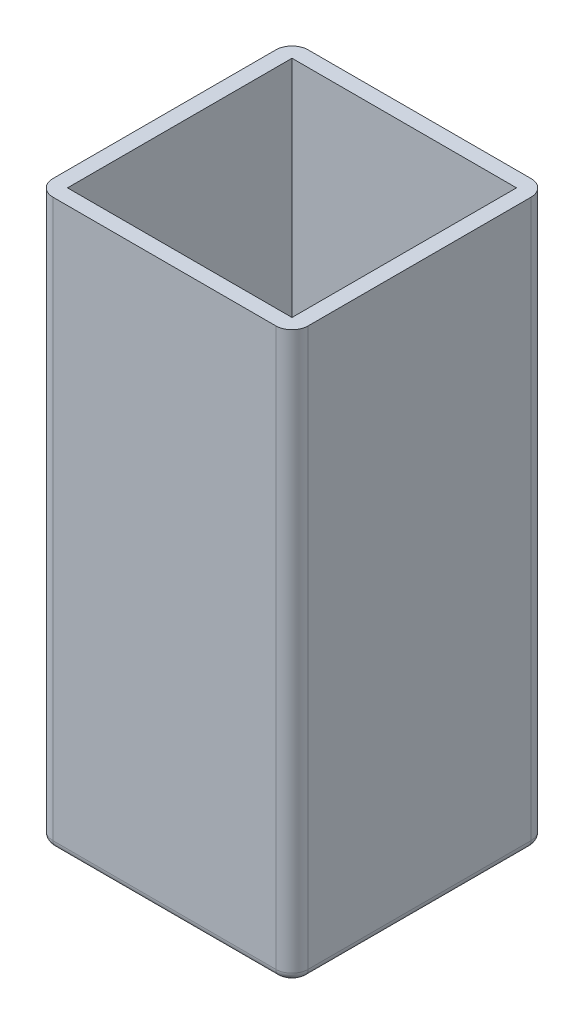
ISO-10303-21;
HEADER;
FILE_DESCRIPTION(('STEP AP214'),'2;1');
FILE_NAME('part.step','',(''),(''),'','','');
FILE_SCHEMA(('AUTOMOTIVE_DESIGN { 1 0 10303 214 1 1 1 1 }'));
ENDSEC;
DATA;
#1=APPLICATION_CONTEXT('core data for automotive mechanical design processes');
#2=APPLICATION_PROTOCOL_DEFINITION('international standard','automotive_design',2000,#1);
#3=PRODUCT_CONTEXT('',#1,'mechanical');
#4=PRODUCT('Part','Part','',(#3));
#5=PRODUCT_RELATED_PRODUCT_CATEGORY('part','',(#4));
#6=PRODUCT_DEFINITION_FORMATION('','',#4);
#7=PRODUCT_DEFINITION_CONTEXT('part definition',#1,'design');
#8=PRODUCT_DEFINITION('design','',#6,#7);
#9=PRODUCT_DEFINITION_SHAPE('','',#8);
#10=(LENGTH_UNIT() NAMED_UNIT(*) SI_UNIT(.MILLI.,.METRE.));
#11=(NAMED_UNIT(*) PLANE_ANGLE_UNIT() SI_UNIT($,.RADIAN.));
#12=(NAMED_UNIT(*) SI_UNIT($,.STERADIAN.) SOLID_ANGLE_UNIT());
#13=UNCERTAINTY_MEASURE_WITH_UNIT(LENGTH_MEASURE(1.E-05),#10,'distance_accuracy_value','');
#14=(GEOMETRIC_REPRESENTATION_CONTEXT(3) GLOBAL_UNCERTAINTY_ASSIGNED_CONTEXT((#13)) GLOBAL_UNIT_ASSIGNED_CONTEXT((#10,
#11,#12)) REPRESENTATION_CONTEXT('',''));
#15=CARTESIAN_POINT('',(0.,0.,0.));
#16=DIRECTION('',(0.,0.,1.));
#17=DIRECTION('',(1.,0.,0.));
#18=AXIS2_PLACEMENT_3D('',#15,#16,#17);
#19=CARTESIAN_POINT('',(0.,34.,0.));
#20=DIRECTION('',(0.,1.,0.));
#21=DIRECTION('',(0.,0.,1.));
#22=AXIS2_PLACEMENT_3D('',#19,#20,#21);
#23=PLANE('',#22);
#24=DIRECTION('',(-1.,0.,0.));
#25=VECTOR('',#24,1.);
#26=CARTESIAN_POINT('',(-7.9,34.,-7.9));
#27=LINE('',#26,#25);
#28=CARTESIAN_POINT('',(6.9,34.,-7.9));
#29=VERTEX_POINT('',#28);
#30=CARTESIAN_POINT('',(-6.9,34.,-7.9));
#31=VERTEX_POINT('',#30);
#32=EDGE_CURVE('E193',#29,#31,#27,.T.);
#33=ORIENTED_EDGE('',*,*,#32,.T.);
#34=CARTESIAN_POINT('',(-6.9,34.,-6.9));
#35=DIRECTION('',(0.,1.,0.));
#36=DIRECTION('',(0.,0.,1.));
#37=AXIS2_PLACEMENT_3D('',#34,#35,#36);
#38=CIRCLE('',#37,1.);
#39=CARTESIAN_POINT('',(-7.9,34.,-6.9));
#40=VERTEX_POINT('',#39);
#41=EDGE_CURVE('E217',#31,#40,#38,.T.);
#42=ORIENTED_EDGE('',*,*,#41,.T.);
#43=DIRECTION('',(0.,0.,1.));
#44=VECTOR('',#43,1.);
#45=CARTESIAN_POINT('',(-7.9,34.,-7.9));
#46=LINE('',#45,#44);
#47=CARTESIAN_POINT('',(-7.9,34.,6.9));
#48=VERTEX_POINT('',#47);
#49=EDGE_CURVE('E196',#40,#48,#46,.T.);
#50=ORIENTED_EDGE('',*,*,#49,.T.);
#51=CARTESIAN_POINT('',(-6.9,34.,6.9));
#52=DIRECTION('',(0.,1.,0.));
#53=DIRECTION('',(0.,0.,1.));
#54=AXIS2_PLACEMENT_3D('',#51,#52,#53);
#55=CIRCLE('',#54,1.);
#56=CARTESIAN_POINT('',(-6.9,34.,7.9));
#57=VERTEX_POINT('',#56);
#58=EDGE_CURVE('E213',#48,#57,#55,.T.);
#59=ORIENTED_EDGE('',*,*,#58,.T.);
#60=DIRECTION('',(1.,0.,0.));
#61=VECTOR('',#60,1.);
#62=CARTESIAN_POINT('',(-7.9,34.,7.9));
#63=LINE('',#62,#61);
#64=CARTESIAN_POINT('',(6.9,34.,7.9));
#65=VERTEX_POINT('',#64);
#66=EDGE_CURVE('E199',#57,#65,#63,.T.);
#67=ORIENTED_EDGE('',*,*,#66,.T.);
#68=CARTESIAN_POINT('',(6.9,34.,6.9));
#69=DIRECTION('',(0.,1.,0.));
#70=DIRECTION('',(0.,0.,1.));
#71=AXIS2_PLACEMENT_3D('',#68,#69,#70);
#72=CIRCLE('',#71,1.);
#73=CARTESIAN_POINT('',(7.9,34.,6.9));
#74=VERTEX_POINT('',#73);
#75=EDGE_CURVE('E211',#65,#74,#72,.T.);
#76=ORIENTED_EDGE('',*,*,#75,.T.);
#77=DIRECTION('',(0.,0.,-1.));
#78=VECTOR('',#77,1.);
#79=CARTESIAN_POINT('',(7.9,34.,-7.9));
#80=LINE('',#79,#78);
#81=CARTESIAN_POINT('',(7.9,34.,-6.9));
#82=VERTEX_POINT('',#81);
#83=EDGE_CURVE('E190',#74,#82,#80,.T.);
#84=ORIENTED_EDGE('',*,*,#83,.T.);
#85=CARTESIAN_POINT('',(6.9,34.,-6.9));
#86=DIRECTION('',(0.,1.,0.));
#87=DIRECTION('',(0.,0.,1.));
#88=AXIS2_PLACEMENT_3D('',#85,#86,#87);
#89=CIRCLE('',#88,1.);
#90=EDGE_CURVE('E215',#82,#29,#89,.T.);
#91=ORIENTED_EDGE('',*,*,#90,.T.);
#92=EDGE_LOOP('',(#33,#42,#50,#59,#67,#76,#84,#91));
#93=FACE_BOUND('',#92,.T.);
#94=DIRECTION('',(0.,0.,1.));
#95=VECTOR('',#94,1.);
#96=CARTESIAN_POINT('',(-6.95,34.,-6.95));
#97=LINE('',#96,#95);
#98=CARTESIAN_POINT('',(-6.95,34.,-6.95));
#99=VERTEX_POINT('',#98);
#100=CARTESIAN_POINT('',(-6.95,34.,6.95));
#101=VERTEX_POINT('',#100);
#102=EDGE_CURVE('E181',#99,#101,#97,.T.);
#103=ORIENTED_EDGE('',*,*,#102,.F.);
#104=DIRECTION('',(-1.,0.,0.));
#105=VECTOR('',#104,1.);
#106=CARTESIAN_POINT('',(-6.95,34.,-6.95));
#107=LINE('',#106,#105);
#108=CARTESIAN_POINT('',(6.95,34.,-6.95));
#109=VERTEX_POINT('',#108);
#110=EDGE_CURVE('E179',#109,#99,#107,.T.);
#111=ORIENTED_EDGE('',*,*,#110,.F.);
#112=DIRECTION('',(0.,0.,-1.));
#113=VECTOR('',#112,1.);
#114=CARTESIAN_POINT('',(6.95,34.,-6.95));
#115=LINE('',#114,#113);
#116=CARTESIAN_POINT('',(6.95,34.,6.95));
#117=VERTEX_POINT('',#116);
#118=EDGE_CURVE('E161',#117,#109,#115,.T.);
#119=ORIENTED_EDGE('',*,*,#118,.F.);
#120=DIRECTION('',(1.,0.,0.));
#121=VECTOR('',#120,1.);
#122=CARTESIAN_POINT('',(-6.95,34.,6.95));
#123=LINE('',#122,#121);
#124=EDGE_CURVE('E601',#101,#117,#123,.T.);
#125=ORIENTED_EDGE('',*,*,#124,.F.);
#126=EDGE_LOOP('',(#103,#111,#119,#125));
#127=FACE_BOUND('',#126,.T.);
#128=ADVANCED_FACE('F39',(#93,#127),#23,.T.);
#129=CARTESIAN_POINT('',(7.9,34.,-7.9));
#130=DIRECTION('',(-1.,0.,0.));
#131=DIRECTION('',(0.,0.,1.));
#132=AXIS2_PLACEMENT_3D('',#129,#130,#131);
#133=PLANE('',#132);
#134=DIRECTION('',(0.,-1.,0.));
#135=VECTOR('',#134,1.);
#136=CARTESIAN_POINT('',(7.9,34.,6.9));
#137=LINE('',#136,#135);
#138=CARTESIAN_POINT('',(7.9,-0.5,6.9));
#139=VERTEX_POINT('',#138);
#140=EDGE_CURVE('E219',#74,#139,#137,.T.);
#141=ORIENTED_EDGE('',*,*,#140,.T.);
#142=DIRECTION('',(0.,0.,1.));
#143=VECTOR('',#142,1.);
#144=CARTESIAN_POINT('',(7.9,-0.5,-6.9));
#145=LINE('',#144,#143);
#146=CARTESIAN_POINT('',(7.9,-0.5,-6.9));
#147=VERTEX_POINT('',#146);
#148=EDGE_CURVE('E248',#139,#147,#145,.F.);
#149=ORIENTED_EDGE('',*,*,#148,.T.);
#150=DIRECTION('',(0.,-1.,0.));
#151=VECTOR('',#150,1.);
#152=CARTESIAN_POINT('',(7.9,34.,-6.9));
#153=LINE('',#152,#151);
#154=EDGE_CURVE('E222',#147,#82,#153,.F.);
#155=ORIENTED_EDGE('',*,*,#154,.T.);
#156=ORIENTED_EDGE('',*,*,#83,.F.);
#157=EDGE_LOOP('',(#141,#149,#155,#156));
#158=FACE_BOUND('',#157,.T.);
#159=ADVANCED_FACE('F325',(#158),#133,.F.);
#160=CARTESIAN_POINT('',(-7.9,34.,-7.9));
#161=DIRECTION('',(0.,0.,1.));
#162=DIRECTION('',(1.,0.,0.));
#163=AXIS2_PLACEMENT_3D('',#160,#161,#162);
#164=PLANE('',#163);
#165=DIRECTION('',(0.,-1.,0.));
#166=VECTOR('',#165,1.);
#167=CARTESIAN_POINT('',(6.9,34.,-7.9));
#168=LINE('',#167,#166);
#169=CARTESIAN_POINT('',(6.9,-0.5,-7.9));
#170=VERTEX_POINT('',#169);
#171=EDGE_CURVE('E206',#29,#170,#168,.T.);
#172=ORIENTED_EDGE('',*,*,#171,.T.);
#173=DIRECTION('',(1.,0.,0.));
#174=VECTOR('',#173,1.);
#175=CARTESIAN_POINT('',(-6.9,-0.5,-7.9));
#176=LINE('',#175,#174);
#177=CARTESIAN_POINT('',(-6.9,-0.5,-7.9));
#178=VERTEX_POINT('',#177);
#179=EDGE_CURVE('E252',#170,#178,#176,.F.);
#180=ORIENTED_EDGE('',*,*,#179,.T.);
#181=DIRECTION('',(0.,-1.,0.));
#182=VECTOR('',#181,1.);
#183=CARTESIAN_POINT('',(-6.9,34.,-7.9));
#184=LINE('',#183,#182);
#185=EDGE_CURVE('E209',#178,#31,#184,.F.);
#186=ORIENTED_EDGE('',*,*,#185,.T.);
#187=ORIENTED_EDGE('',*,*,#32,.F.);
#188=EDGE_LOOP('',(#172,#180,#186,#187));
#189=FACE_BOUND('',#188,.T.);
#190=ADVANCED_FACE('F334',(#189),#164,.F.);
#191=CARTESIAN_POINT('',(-7.9,34.,-7.9));
#192=DIRECTION('',(1.,0.,0.));
#193=DIRECTION('',(0.,0.,-1.));
#194=AXIS2_PLACEMENT_3D('',#191,#192,#193);
#195=PLANE('',#194);
#196=DIRECTION('',(0.,-1.,0.));
#197=VECTOR('',#196,1.);
#198=CARTESIAN_POINT('',(-7.9,34.,-6.9));
#199=LINE('',#198,#197);
#200=CARTESIAN_POINT('',(-7.9,-0.5,-6.9));
#201=VERTEX_POINT('',#200);
#202=EDGE_CURVE('E204',#40,#201,#199,.T.);
#203=ORIENTED_EDGE('',*,*,#202,.T.);
#204=DIRECTION('',(0.,0.,-1.));
#205=VECTOR('',#204,1.);
#206=CARTESIAN_POINT('',(-7.9,-0.5,6.9));
#207=LINE('',#206,#205);
#208=CARTESIAN_POINT('',(-7.9,-0.5,6.9));
#209=VERTEX_POINT('',#208);
#210=EDGE_CURVE('E63',#201,#209,#207,.F.);
#211=ORIENTED_EDGE('',*,*,#210,.T.);
#212=DIRECTION('',(0.,-1.,0.));
#213=VECTOR('',#212,1.);
#214=CARTESIAN_POINT('',(-7.9,34.,6.9));
#215=LINE('',#214,#213);
#216=EDGE_CURVE('E202',#209,#48,#215,.F.);
#217=ORIENTED_EDGE('',*,*,#216,.T.);
#218=ORIENTED_EDGE('',*,*,#49,.F.);
#219=EDGE_LOOP('',(#203,#211,#217,#218));
#220=FACE_BOUND('',#219,.T.);
#221=ADVANCED_FACE('F294',(#220),#195,.F.);
#222=CARTESIAN_POINT('',(-7.9,34.,7.9));
#223=DIRECTION('',(0.,0.,-1.));
#224=DIRECTION('',(-1.,0.,0.));
#225=AXIS2_PLACEMENT_3D('',#222,#223,#224);
#226=PLANE('',#225);
#227=DIRECTION('',(0.,-1.,0.));
#228=VECTOR('',#227,1.);
#229=CARTESIAN_POINT('',(-6.9,34.,7.9));
#230=LINE('',#229,#228);
#231=CARTESIAN_POINT('',(-6.9,-0.5,7.9));
#232=VERTEX_POINT('',#231);
#233=EDGE_CURVE('E226',#57,#232,#230,.T.);
#234=ORIENTED_EDGE('',*,*,#233,.T.);
#235=DIRECTION('',(-1.,0.,0.));
#236=VECTOR('',#235,1.);
#237=CARTESIAN_POINT('',(6.9,-0.5,7.9));
#238=LINE('',#237,#236);
#239=CARTESIAN_POINT('',(6.9,-0.5,7.9));
#240=VERTEX_POINT('',#239);
#241=EDGE_CURVE('E11',#232,#240,#238,.F.);
#242=ORIENTED_EDGE('',*,*,#241,.T.);
#243=DIRECTION('',(0.,-1.,0.));
#244=VECTOR('',#243,1.);
#245=CARTESIAN_POINT('',(6.9,34.,7.9));
#246=LINE('',#245,#244);
#247=EDGE_CURVE('E224',#240,#65,#246,.F.);
#248=ORIENTED_EDGE('',*,*,#247,.T.);
#249=ORIENTED_EDGE('',*,*,#66,.F.);
#250=EDGE_LOOP('',(#234,#242,#248,#249));
#251=FACE_BOUND('',#250,.T.);
#252=ADVANCED_FACE('F303',(#251),#226,.F.);
#253=CARTESIAN_POINT('',(-6.95,34.,-6.95));
#254=DIRECTION('',(0.,0.,1.));
#255=DIRECTION('',(1.,0.,0.));
#256=AXIS2_PLACEMENT_3D('',#253,#254,#255);
#257=PLANE('',#256);
#258=DIRECTION('',(-1.,0.,0.));
#259=VECTOR('',#258,1.);
#260=CARTESIAN_POINT('',(-6.95,0.,-6.95));
#261=LINE('',#260,#259);
#262=CARTESIAN_POINT('',(6.95,0.,-6.95));
#263=VERTEX_POINT('',#262);
#264=CARTESIAN_POINT('',(-6.95,0.,-6.95));
#265=VERTEX_POINT('',#264);
#266=EDGE_CURVE('E168',#263,#265,#261,.T.);
#267=ORIENTED_EDGE('',*,*,#266,.F.);
#268=DIRECTION('',(0.,-1.,0.));
#269=VECTOR('',#268,1.);
#270=CARTESIAN_POINT('',(6.95,34.,-6.95));
#271=LINE('',#270,#269);
#272=EDGE_CURVE('E154',#109,#263,#271,.T.);
#273=ORIENTED_EDGE('',*,*,#272,.F.);
#274=ORIENTED_EDGE('',*,*,#110,.T.);
#275=DIRECTION('',(0.,-1.,0.));
#276=VECTOR('',#275,1.);
#277=CARTESIAN_POINT('',(-6.95,34.,-6.95));
#278=LINE('',#277,#276);
#279=EDGE_CURVE('E171',#99,#265,#278,.T.);
#280=ORIENTED_EDGE('',*,*,#279,.T.);
#281=EDGE_LOOP('',(#267,#273,#274,#280));
#282=FACE_BOUND('',#281,.T.);
#283=ADVANCED_FACE('F169',(#282),#257,.T.);
#284=CARTESIAN_POINT('',(-6.95,34.,-6.95));
#285=DIRECTION('',(1.,0.,0.));
#286=DIRECTION('',(0.,0.,-1.));
#287=AXIS2_PLACEMENT_3D('',#284,#285,#286);
#288=PLANE('',#287);
#289=DIRECTION('',(0.,0.,1.));
#290=VECTOR('',#289,1.);
#291=CARTESIAN_POINT('',(-6.95,0.,-6.95));
#292=LINE('',#291,#290);
#293=CARTESIAN_POINT('',(-6.95,0.,6.95));
#294=VERTEX_POINT('',#293);
#295=EDGE_CURVE('E174',#265,#294,#292,.T.);
#296=ORIENTED_EDGE('',*,*,#295,.F.);
#297=ORIENTED_EDGE('',*,*,#279,.F.);
#298=ORIENTED_EDGE('',*,*,#102,.T.);
#299=DIRECTION('',(0.,-1.,0.));
#300=VECTOR('',#299,1.);
#301=CARTESIAN_POINT('',(-6.95,34.,6.95));
#302=LINE('',#301,#300);
#303=EDGE_CURVE('E187',#101,#294,#302,.T.);
#304=ORIENTED_EDGE('',*,*,#303,.T.);
#305=EDGE_LOOP('',(#296,#297,#298,#304));
#306=FACE_BOUND('',#305,.T.);
#307=ADVANCED_FACE('F354',(#306),#288,.T.);
#308=CARTESIAN_POINT('',(-6.95,34.,6.95));
#309=DIRECTION('',(0.,0.,-1.));
#310=DIRECTION('',(-1.,0.,0.));
#311=AXIS2_PLACEMENT_3D('',#308,#309,#310);
#312=PLANE('',#311);
#313=DIRECTION('',(1.,0.,0.));
#314=VECTOR('',#313,1.);
#315=CARTESIAN_POINT('',(-6.95,0.,6.95));
#316=LINE('',#315,#314);
#317=CARTESIAN_POINT('',(6.95,0.,6.95));
#318=VERTEX_POINT('',#317);
#319=EDGE_CURVE('E178',#294,#318,#316,.T.);
#320=ORIENTED_EDGE('',*,*,#319,.F.);
#321=ORIENTED_EDGE('',*,*,#303,.F.);
#322=ORIENTED_EDGE('',*,*,#124,.T.);
#323=DIRECTION('',(0.,-1.,0.));
#324=VECTOR('',#323,1.);
#325=CARTESIAN_POINT('',(6.95,34.,6.95));
#326=LINE('',#325,#324);
#327=EDGE_CURVE('E164',#117,#318,#326,.T.);
#328=ORIENTED_EDGE('',*,*,#327,.T.);
#329=EDGE_LOOP('',(#320,#321,#322,#328));
#330=FACE_BOUND('',#329,.T.);
#331=ADVANCED_FACE('F358',(#330),#312,.T.);
#332=CARTESIAN_POINT('',(6.95,34.,-6.95));
#333=DIRECTION('',(-1.,0.,0.));
#334=DIRECTION('',(0.,0.,1.));
#335=AXIS2_PLACEMENT_3D('',#332,#333,#334);
#336=PLANE('',#335);
#337=DIRECTION('',(0.,0.,-1.));
#338=VECTOR('',#337,1.);
#339=CARTESIAN_POINT('',(6.95,0.,-6.95));
#340=LINE('',#339,#338);
#341=EDGE_CURVE('E158',#318,#263,#340,.T.);
#342=ORIENTED_EDGE('',*,*,#341,.F.);
#343=ORIENTED_EDGE('',*,*,#327,.F.);
#344=ORIENTED_EDGE('',*,*,#118,.T.);
#345=ORIENTED_EDGE('',*,*,#272,.T.);
#346=EDGE_LOOP('',(#342,#343,#344,#345));
#347=FACE_BOUND('',#346,.T.);
#348=ADVANCED_FACE('F156',(#347),#336,.T.);
#349=CARTESIAN_POINT('',(0.,0.,0.));
#350=DIRECTION('',(0.,-1.,0.));
#351=DIRECTION('',(0.,0.,-1.));
#352=AXIS2_PLACEMENT_3D('',#349,#350,#351);
#353=PLANE('',#352);
#354=ORIENTED_EDGE('',*,*,#341,.T.);
#355=ORIENTED_EDGE('',*,*,#266,.T.);
#356=ORIENTED_EDGE('',*,*,#295,.T.);
#357=ORIENTED_EDGE('',*,*,#319,.T.);
#358=EDGE_LOOP('',(#354,#355,#356,#357));
#359=FACE_BOUND('',#358,.T.);
#360=ADVANCED_FACE('F176',(#359),#353,.F.);
#361=CARTESIAN_POINT('',(0.,-1.,0.));
#362=DIRECTION('',(0.,-1.,0.));
#363=DIRECTION('',(0.,0.,-1.));
#364=AXIS2_PLACEMENT_3D('',#361,#362,#363);
#365=PLANE('',#364);
#366=DIRECTION('',(0.,0.,1.));
#367=VECTOR('',#366,1.);
#368=CARTESIAN_POINT('',(7.4,-1.,6.9));
#369=LINE('',#368,#367);
#370=CARTESIAN_POINT('',(7.4,-1.,-6.9));
#371=VERTEX_POINT('',#370);
#372=CARTESIAN_POINT('',(7.4,-1.,6.9));
#373=VERTEX_POINT('',#372);
#374=EDGE_CURVE('E240',#371,#373,#369,.T.);
#375=ORIENTED_EDGE('',*,*,#374,.T.);
#376=CARTESIAN_POINT('',(6.9,-1.,6.9));
#377=DIRECTION('',(0.,-1.,0.));
#378=DIRECTION('',(0.,0.,-1.));
#379=AXIS2_PLACEMENT_3D('',#376,#377,#378);
#380=CIRCLE('',#379,0.5);
#381=CARTESIAN_POINT('',(6.9,-1.,7.4));
#382=VERTEX_POINT('',#381);
#383=EDGE_CURVE('E242',#373,#382,#380,.T.);
#384=ORIENTED_EDGE('',*,*,#383,.T.);
#385=DIRECTION('',(-1.,0.,0.));
#386=VECTOR('',#385,1.);
#387=CARTESIAN_POINT('',(-6.9,-1.,7.4));
#388=LINE('',#387,#386);
#389=CARTESIAN_POINT('',(-6.9,-1.,7.4));
#390=VERTEX_POINT('',#389);
#391=EDGE_CURVE('E228',#382,#390,#388,.T.);
#392=ORIENTED_EDGE('',*,*,#391,.T.);
#393=CARTESIAN_POINT('',(-6.9,-1.,6.9));
#394=DIRECTION('',(0.,-1.,0.));
#395=DIRECTION('',(0.,0.,-1.));
#396=AXIS2_PLACEMENT_3D('',#393,#394,#395);
#397=CIRCLE('',#396,0.5);
#398=CARTESIAN_POINT('',(-7.4,-1.,6.9));
#399=VERTEX_POINT('',#398);
#400=EDGE_CURVE('E230',#390,#399,#397,.T.);
#401=ORIENTED_EDGE('',*,*,#400,.T.);
#402=DIRECTION('',(0.,0.,-1.));
#403=VECTOR('',#402,1.);
#404=CARTESIAN_POINT('',(-7.4,-1.,-6.9));
#405=LINE('',#404,#403);
#406=CARTESIAN_POINT('',(-7.4,-1.,-6.9));
#407=VERTEX_POINT('',#406);
#408=EDGE_CURVE('E232',#399,#407,#405,.T.);
#409=ORIENTED_EDGE('',*,*,#408,.T.);
#410=CARTESIAN_POINT('',(-6.9,-1.,-6.9));
#411=DIRECTION('',(0.,-1.,0.));
#412=DIRECTION('',(0.,0.,-1.));
#413=AXIS2_PLACEMENT_3D('',#410,#411,#412);
#414=CIRCLE('',#413,0.5);
#415=CARTESIAN_POINT('',(-6.9,-1.,-7.4));
#416=VERTEX_POINT('',#415);
#417=EDGE_CURVE('E234',#407,#416,#414,.T.);
#418=ORIENTED_EDGE('',*,*,#417,.T.);
#419=DIRECTION('',(1.,0.,0.));
#420=VECTOR('',#419,1.);
#421=CARTESIAN_POINT('',(6.9,-1.,-7.4));
#422=LINE('',#421,#420);
#423=CARTESIAN_POINT('',(6.9,-1.,-7.4));
#424=VERTEX_POINT('',#423);
#425=EDGE_CURVE('E236',#416,#424,#422,.T.);
#426=ORIENTED_EDGE('',*,*,#425,.T.);
#427=CARTESIAN_POINT('',(6.9,-1.,-6.9));
#428=DIRECTION('',(0.,-1.,0.));
#429=DIRECTION('',(0.,0.,-1.));
#430=AXIS2_PLACEMENT_3D('',#427,#428,#429);
#431=CIRCLE('',#430,0.5);
#432=EDGE_CURVE('E238',#424,#371,#431,.T.);
#433=ORIENTED_EDGE('',*,*,#432,.T.);
#434=EDGE_LOOP('',(#375,#384,#392,#401,#409,#418,#426,#433));
#435=FACE_BOUND('',#434,.T.);
#436=ADVANCED_FACE('F370',(#435),#365,.T.);
#437=CARTESIAN_POINT('',(-6.9,34.,-6.9));
#438=DIRECTION('',(0.,-1.,0.));
#439=DIRECTION('',(0.,0.,-1.));
#440=AXIS2_PLACEMENT_3D('',#437,#438,#439);
#441=CYLINDRICAL_SURFACE('',#440,1.);
#442=ORIENTED_EDGE('',*,*,#185,.F.);
#443=CARTESIAN_POINT('',(-6.9,-0.5,-6.9));
#444=DIRECTION('',(0.,-1.,0.));
#445=DIRECTION('',(0.,0.,-1.));
#446=AXIS2_PLACEMENT_3D('',#443,#444,#445);
#447=CIRCLE('',#446,1.);
#448=EDGE_CURVE('E254',#178,#201,#447,.F.);
#449=ORIENTED_EDGE('',*,*,#448,.T.);
#450=ORIENTED_EDGE('',*,*,#202,.F.);
#451=ORIENTED_EDGE('',*,*,#41,.F.);
#452=EDGE_LOOP('',(#442,#449,#450,#451));
#453=FACE_BOUND('',#452,.T.);
#454=ADVANCED_FACE('F291',(#453),#441,.T.);
#455=CARTESIAN_POINT('',(6.9,34.,-6.9));
#456=DIRECTION('',(0.,-1.,0.));
#457=DIRECTION('',(0.,0.,-1.));
#458=AXIS2_PLACEMENT_3D('',#455,#456,#457);
#459=CYLINDRICAL_SURFACE('',#458,1.);
#460=ORIENTED_EDGE('',*,*,#154,.F.);
#461=CARTESIAN_POINT('',(6.9,-0.5,-6.9));
#462=DIRECTION('',(0.,-1.,0.));
#463=DIRECTION('',(0.,0.,-1.));
#464=AXIS2_PLACEMENT_3D('',#461,#462,#463);
#465=CIRCLE('',#464,1.);
#466=EDGE_CURVE('E250',#147,#170,#465,.F.);
#467=ORIENTED_EDGE('',*,*,#466,.T.);
#468=ORIENTED_EDGE('',*,*,#171,.F.);
#469=ORIENTED_EDGE('',*,*,#90,.F.);
#470=EDGE_LOOP('',(#460,#467,#468,#469));
#471=FACE_BOUND('',#470,.T.);
#472=ADVANCED_FACE('F331',(#471),#459,.T.);
#473=CARTESIAN_POINT('',(-6.9,34.,6.9));
#474=DIRECTION('',(0.,-1.,0.));
#475=DIRECTION('',(0.,0.,-1.));
#476=AXIS2_PLACEMENT_3D('',#473,#474,#475);
#477=CYLINDRICAL_SURFACE('',#476,1.);
#478=ORIENTED_EDGE('',*,*,#216,.F.);
#479=CARTESIAN_POINT('',(-6.9,-0.5,6.9));
#480=DIRECTION('',(0.,-1.,0.));
#481=DIRECTION('',(0.,0.,-1.));
#482=AXIS2_PLACEMENT_3D('',#479,#480,#481);
#483=CIRCLE('',#482,1.);
#484=EDGE_CURVE('E48',#209,#232,#483,.F.);
#485=ORIENTED_EDGE('',*,*,#484,.T.);
#486=ORIENTED_EDGE('',*,*,#233,.F.);
#487=ORIENTED_EDGE('',*,*,#58,.F.);
#488=EDGE_LOOP('',(#478,#485,#486,#487));
#489=FACE_BOUND('',#488,.T.);
#490=ADVANCED_FACE('F299',(#489),#477,.T.);
#491=CARTESIAN_POINT('',(6.9,34.,6.9));
#492=DIRECTION('',(0.,-1.,0.));
#493=DIRECTION('',(0.,0.,-1.));
#494=AXIS2_PLACEMENT_3D('',#491,#492,#493);
#495=CYLINDRICAL_SURFACE('',#494,1.);
#496=ORIENTED_EDGE('',*,*,#247,.F.);
#497=CARTESIAN_POINT('',(6.9,-0.5,6.9));
#498=DIRECTION('',(0.,-1.,0.));
#499=DIRECTION('',(0.,0.,-1.));
#500=AXIS2_PLACEMENT_3D('',#497,#498,#499);
#501=CIRCLE('',#500,1.);
#502=EDGE_CURVE('E245',#240,#139,#501,.F.);
#503=ORIENTED_EDGE('',*,*,#502,.T.);
#504=ORIENTED_EDGE('',*,*,#140,.F.);
#505=ORIENTED_EDGE('',*,*,#75,.F.);
#506=EDGE_LOOP('',(#496,#503,#504,#505));
#507=FACE_BOUND('',#506,.T.);
#508=ADVANCED_FACE('F321',(#507),#495,.T.);
#509=CARTESIAN_POINT('',(-6.9,-0.5,-6.9));
#510=DIRECTION('',(0.,-1.,0.));
#511=DIRECTION('',(0.,0.,-1.));
#512=AXIS2_PLACEMENT_3D('',#509,#510,#511);
#513=DEGENERATE_TOROIDAL_SURFACE('',#512,0.5,0.5,.T.);
#514=CARTESIAN_POINT('',(-7.4,-0.5,-6.9));
#515=DIRECTION('',(0.,0.,1.));
#516=DIRECTION('',(1.,0.,0.));
#517=AXIS2_PLACEMENT_3D('',#514,#515,#516);
#518=CIRCLE('',#517,0.5);
#519=EDGE_CURVE('E273',#201,#407,#518,.T.);
#520=ORIENTED_EDGE('',*,*,#519,.F.);
#521=ORIENTED_EDGE('',*,*,#448,.F.);
#522=CARTESIAN_POINT('',(-6.9,-0.5,-7.4));
#523=DIRECTION('',(1.,0.,0.));
#524=DIRECTION('',(0.,0.,-1.));
#525=AXIS2_PLACEMENT_3D('',#522,#523,#524);
#526=CIRCLE('',#525,0.5);
#527=EDGE_CURVE('E43',#416,#178,#526,.T.);
#528=ORIENTED_EDGE('',*,*,#527,.F.);
#529=ORIENTED_EDGE('',*,*,#417,.F.);
#530=EDGE_LOOP('',(#520,#521,#528,#529));
#531=FACE_BOUND('',#530,.T.);
#532=ADVANCED_FACE('F41',(#531),#513,.T.);
#533=CARTESIAN_POINT('',(0.,-0.5,-7.4));
#534=DIRECTION('',(-1.,0.,0.));
#535=DIRECTION('',(0.,0.,1.));
#536=AXIS2_PLACEMENT_3D('',#533,#534,#535);
#537=CYLINDRICAL_SURFACE('',#536,0.5);
#538=ORIENTED_EDGE('',*,*,#527,.T.);
#539=ORIENTED_EDGE('',*,*,#179,.F.);
#540=CARTESIAN_POINT('',(6.9,-0.5,-7.4));
#541=DIRECTION('',(1.,0.,0.));
#542=DIRECTION('',(0.,0.,-1.));
#543=AXIS2_PLACEMENT_3D('',#540,#541,#542);
#544=CIRCLE('',#543,0.5);
#545=EDGE_CURVE('E271',#424,#170,#544,.T.);
#546=ORIENTED_EDGE('',*,*,#545,.F.);
#547=ORIENTED_EDGE('',*,*,#425,.F.);
#548=EDGE_LOOP('',(#538,#539,#546,#547));
#549=FACE_BOUND('',#548,.T.);
#550=ADVANCED_FACE('F283',(#549),#537,.T.);
#551=CARTESIAN_POINT('',(-7.4,-0.5,0.));
#552=DIRECTION('',(0.,0.,1.));
#553=DIRECTION('',(1.,0.,0.));
#554=AXIS2_PLACEMENT_3D('',#551,#552,#553);
#555=CYLINDRICAL_SURFACE('',#554,0.5);
#556=ORIENTED_EDGE('',*,*,#519,.T.);
#557=ORIENTED_EDGE('',*,*,#408,.F.);
#558=CARTESIAN_POINT('',(-7.4,-0.5,6.9));
#559=DIRECTION('',(0.,0.,1.));
#560=DIRECTION('',(1.,0.,0.));
#561=AXIS2_PLACEMENT_3D('',#558,#559,#560);
#562=CIRCLE('',#561,0.5);
#563=EDGE_CURVE('E268',#209,#399,#562,.T.);
#564=ORIENTED_EDGE('',*,*,#563,.F.);
#565=ORIENTED_EDGE('',*,*,#210,.F.);
#566=EDGE_LOOP('',(#556,#557,#564,#565));
#567=FACE_BOUND('',#566,.T.);
#568=ADVANCED_FACE('F385',(#567),#555,.T.);
#569=CARTESIAN_POINT('',(6.9,-0.5,-6.9));
#570=DIRECTION('',(0.,-1.,0.));
#571=DIRECTION('',(0.,0.,-1.));
#572=AXIS2_PLACEMENT_3D('',#569,#570,#571);
#573=DEGENERATE_TOROIDAL_SURFACE('',#572,0.5,0.5,.T.);
#574=ORIENTED_EDGE('',*,*,#545,.T.);
#575=ORIENTED_EDGE('',*,*,#466,.F.);
#576=CARTESIAN_POINT('',(7.4,-0.5,-6.9));
#577=DIRECTION('',(0.,0.,1.));
#578=DIRECTION('',(1.,0.,0.));
#579=AXIS2_PLACEMENT_3D('',#576,#577,#578);
#580=CIRCLE('',#579,0.5);
#581=EDGE_CURVE('E265',#371,#147,#580,.T.);
#582=ORIENTED_EDGE('',*,*,#581,.F.);
#583=ORIENTED_EDGE('',*,*,#432,.F.);
#584=EDGE_LOOP('',(#574,#575,#582,#583));
#585=FACE_BOUND('',#584,.T.);
#586=ADVANCED_FACE('F383',(#585),#573,.T.);
#587=CARTESIAN_POINT('',(-6.9,-0.5,6.9));
#588=DIRECTION('',(0.,-1.,0.));
#589=DIRECTION('',(0.,0.,-1.));
#590=AXIS2_PLACEMENT_3D('',#587,#588,#589);
#591=DEGENERATE_TOROIDAL_SURFACE('',#590,0.5,0.5,.T.);
#592=ORIENTED_EDGE('',*,*,#563,.T.);
#593=ORIENTED_EDGE('',*,*,#400,.F.);
#594=CARTESIAN_POINT('',(-6.9,-0.5,7.4));
#595=DIRECTION('',(1.,0.,0.));
#596=DIRECTION('',(0.,0.,-1.));
#597=AXIS2_PLACEMENT_3D('',#594,#595,#596);
#598=CIRCLE('',#597,0.5);
#599=EDGE_CURVE('E262',#232,#390,#598,.T.);
#600=ORIENTED_EDGE('',*,*,#599,.F.);
#601=ORIENTED_EDGE('',*,*,#484,.F.);
#602=EDGE_LOOP('',(#592,#593,#600,#601));
#603=FACE_BOUND('',#602,.T.);
#604=ADVANCED_FACE('F308',(#603),#591,.T.);
#605=CARTESIAN_POINT('',(7.4,-0.5,0.));
#606=DIRECTION('',(0.,0.,-1.));
#607=DIRECTION('',(-1.,0.,0.));
#608=AXIS2_PLACEMENT_3D('',#605,#606,#607);
#609=CYLINDRICAL_SURFACE('',#608,0.5);
#610=ORIENTED_EDGE('',*,*,#581,.T.);
#611=ORIENTED_EDGE('',*,*,#148,.F.);
#612=CARTESIAN_POINT('',(7.4,-0.5,6.9));
#613=DIRECTION('',(0.,0.,1.));
#614=DIRECTION('',(1.,0.,0.));
#615=AXIS2_PLACEMENT_3D('',#612,#613,#614);
#616=CIRCLE('',#615,0.5);
#617=EDGE_CURVE('E260',#373,#139,#616,.T.);
#618=ORIENTED_EDGE('',*,*,#617,.F.);
#619=ORIENTED_EDGE('',*,*,#374,.F.);
#620=EDGE_LOOP('',(#610,#611,#618,#619));
#621=FACE_BOUND('',#620,.T.);
#622=ADVANCED_FACE('F381',(#621),#609,.T.);
#623=CARTESIAN_POINT('',(0.,-0.5,7.4));
#624=DIRECTION('',(1.,0.,0.));
#625=DIRECTION('',(0.,0.,-1.));
#626=AXIS2_PLACEMENT_3D('',#623,#624,#625);
#627=CYLINDRICAL_SURFACE('',#626,0.5);
#628=ORIENTED_EDGE('',*,*,#599,.T.);
#629=ORIENTED_EDGE('',*,*,#391,.F.);
#630=CARTESIAN_POINT('',(6.9,-0.5,7.4));
#631=DIRECTION('',(1.,0.,0.));
#632=DIRECTION('',(0.,0.,-1.));
#633=AXIS2_PLACEMENT_3D('',#630,#631,#632);
#634=CIRCLE('',#633,0.5);
#635=EDGE_CURVE('E258',#240,#382,#634,.T.);
#636=ORIENTED_EDGE('',*,*,#635,.F.);
#637=ORIENTED_EDGE('',*,*,#241,.F.);
#638=EDGE_LOOP('',(#628,#629,#636,#637));
#639=FACE_BOUND('',#638,.T.);
#640=ADVANCED_FACE('F312',(#639),#627,.T.);
#641=CARTESIAN_POINT('',(6.9,-0.5,6.9));
#642=DIRECTION('',(0.,-1.,0.));
#643=DIRECTION('',(0.,0.,-1.));
#644=AXIS2_PLACEMENT_3D('',#641,#642,#643);
#645=DEGENERATE_TOROIDAL_SURFACE('',#644,0.5,0.5,.T.);
#646=ORIENTED_EDGE('',*,*,#617,.T.);
#647=ORIENTED_EDGE('',*,*,#502,.F.);
#648=ORIENTED_EDGE('',*,*,#635,.T.);
#649=ORIENTED_EDGE('',*,*,#383,.F.);
#650=EDGE_LOOP('',(#646,#647,#648,#649));
#651=FACE_BOUND('',#650,.T.);
#652=ADVANCED_FACE('F316',(#651),#645,.T.);
#653=CLOSED_SHELL('',(#128,#159,#190,#221,#252,#283,#307,#331,#348,#360,#436,#454,#472,#490,
#508,#532,#550,#568,#586,#604,#622,#640,#652));
#654=MANIFOLD_SOLID_BREP('B2',#653);
#655=ADVANCED_BREP_SHAPE_REPRESENTATION('',(#18,#654),#14);
#656=SHAPE_DEFINITION_REPRESENTATION(#9,#655);
ENDSEC;
END-ISO-10303-21;
